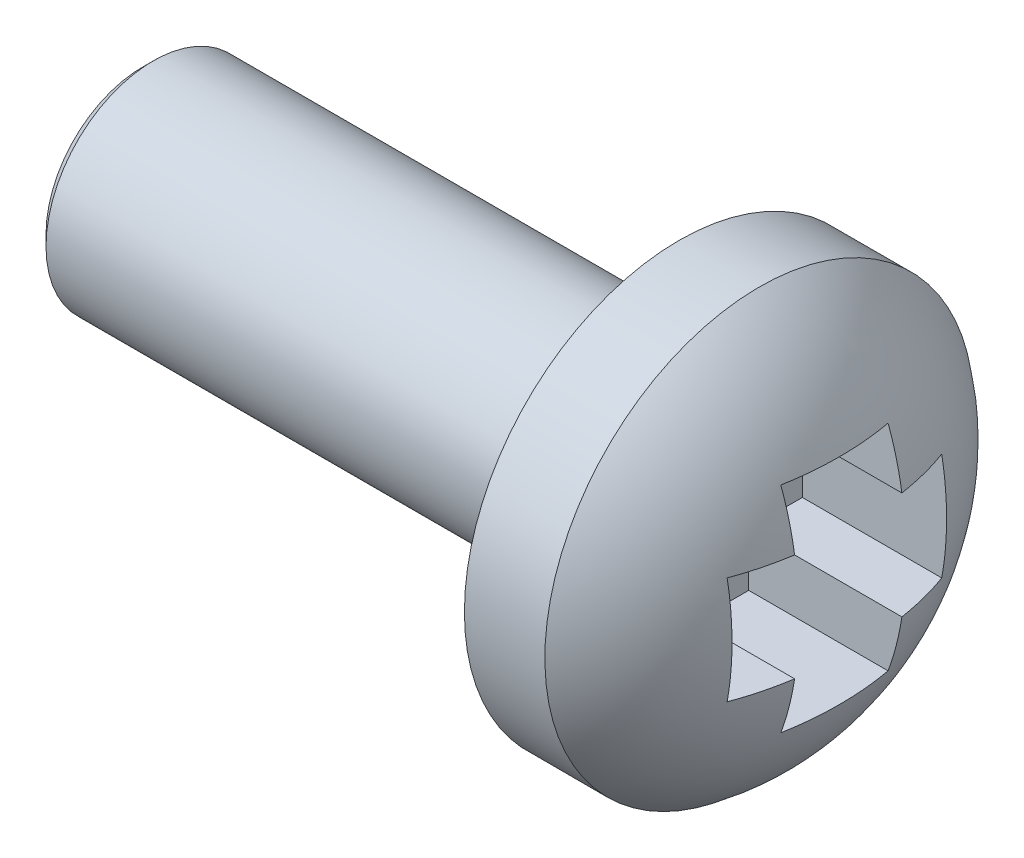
ISO-10303-21;
HEADER;
FILE_DESCRIPTION(('STEP AP214'),'2;1');
FILE_NAME('part.step','',(''),(''),'','','');
FILE_SCHEMA(('AUTOMOTIVE_DESIGN { 1 0 10303 214 1 1 1 1 }'));
ENDSEC;
DATA;
#1=APPLICATION_CONTEXT('core data for automotive mechanical design processes');
#2=APPLICATION_PROTOCOL_DEFINITION('international standard','automotive_design',2000,#1);
#3=PRODUCT_CONTEXT('',#1,'mechanical');
#4=PRODUCT('Part','Part','',(#3));
#5=PRODUCT_RELATED_PRODUCT_CATEGORY('part','',(#4));
#6=PRODUCT_DEFINITION_FORMATION('','',#4);
#7=PRODUCT_DEFINITION_CONTEXT('part definition',#1,'design');
#8=PRODUCT_DEFINITION('design','',#6,#7);
#9=PRODUCT_DEFINITION_SHAPE('','',#8);
#10=(LENGTH_UNIT() NAMED_UNIT(*) SI_UNIT(.MILLI.,.METRE.));
#11=(NAMED_UNIT(*) PLANE_ANGLE_UNIT() SI_UNIT($,.RADIAN.));
#12=(NAMED_UNIT(*) SI_UNIT($,.STERADIAN.) SOLID_ANGLE_UNIT());
#13=UNCERTAINTY_MEASURE_WITH_UNIT(LENGTH_MEASURE(1.E-05),#10,'distance_accuracy_value','');
#14=(GEOMETRIC_REPRESENTATION_CONTEXT(3) GLOBAL_UNCERTAINTY_ASSIGNED_CONTEXT((#13)) GLOBAL_UNIT_ASSIGNED_CONTEXT((#10,
#11,#12)) REPRESENTATION_CONTEXT('',''));
#15=CARTESIAN_POINT('',(0.,0.,0.));
#16=DIRECTION('',(0.,0.,1.));
#17=DIRECTION('',(1.,0.,0.));
#18=AXIS2_PLACEMENT_3D('',#15,#16,#17);
#19=CARTESIAN_POINT('',(3.,0.,0.));
#20=CARTESIAN_POINT('',(3.,-2.69179906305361,0.));
#21=CARTESIAN_POINT('',(1.2,-4.,0.));
#22=B_SPLINE_CURVE_WITH_KNOTS('',2,(#19,#20,#21),.UNSPECIFIED.,.F.,.F.,(3,3),(0.,1.),.UNSPECIFIED.);
#23=CARTESIAN_POINT('',(11.0618266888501,0.,0.));
#24=DIRECTION('',(1.,0.,0.));
#25=AXIS1_PLACEMENT('',#23,#24);
#26=SURFACE_OF_REVOLUTION('',#22,#25);
#27=CARTESIAN_POINT('',(1.2,0.,0.));
#28=DIRECTION('',(1.,0.,0.));
#29=DIRECTION('',(0.,0.,-1.));
#30=AXIS2_PLACEMENT_3D('',#27,#28,#29);
#31=CIRCLE('',#30,4.);
#32=CARTESIAN_POINT('',(1.2,0.,-4.));
#33=VERTEX_POINT('',#32);
#34=EDGE_CURVE('E265',#33,#33,#31,.T.);
#35=ORIENTED_EDGE('',*,*,#34,.T.);
#36=EDGE_LOOP('',(#35));
#37=FACE_BOUND('',#36,.T.);
#38=CARTESIAN_POINT('',(2.59763159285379,1.,2.));
#39=CARTESIAN_POINT('',(2.64990824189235,1.,1.86011806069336));
#40=CARTESIAN_POINT('',(2.69525044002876,1.,1.71774140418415));
#41=CARTESIAN_POINT('',(2.77297852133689,1.,1.43010339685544));
#42=CARTESIAN_POINT('',(2.80541708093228,1.,1.28485636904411));
#43=CARTESIAN_POINT('',(2.83623705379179,1.,1.1155806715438));
#44=CARTESIAN_POINT('',(2.8402891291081,1.,1.09250714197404));
#45=CARTESIAN_POINT('',(2.84811229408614,1.,1.04629699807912));
#46=CARTESIAN_POINT('',(2.85188319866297,1.,1.02316035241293));
#47=CARTESIAN_POINT('',(2.85551487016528,1.,0.999999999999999));
#48=B_SPLINE_CURVE_WITH_KNOTS('',3,(#38,#39,#40,#41,#42,#43,#44,#45,#46,#47),.UNSPECIFIED.,.F.,
.F.,(4,2,2,2,4),(0.,0.44771087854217,0.893574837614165,0.963854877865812,1.0341807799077),.UNSPECIFIED.);
#49=CARTESIAN_POINT('',(2.59763159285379,1.,2.));
#50=VERTEX_POINT('',#49);
#51=CARTESIAN_POINT('',(2.85551487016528,1.,0.999999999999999));
#52=VERTEX_POINT('',#51);
#53=EDGE_CURVE('E167',#50,#52,#48,.T.);
#54=ORIENTED_EDGE('',*,*,#53,.T.);
#55=CARTESIAN_POINT('',(2.85551487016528,1.,0.999999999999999));
#56=CARTESIAN_POINT('',(2.84882371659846,1.04267279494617,0.999999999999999));
#57=CARTESIAN_POINT('',(2.84165816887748,1.08527202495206,0.999999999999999));
#58=CARTESIAN_POINT('',(2.8263643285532,1.17021744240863,0.999999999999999));
#59=CARTESIAN_POINT('',(2.81823780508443,1.21256394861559,0.999999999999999));
#60=CARTESIAN_POINT('',(2.80099503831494,1.29699886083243,0.999999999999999));
#61=CARTESIAN_POINT('',(2.7918800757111,1.33908752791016,0.999999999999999));
#62=CARTESIAN_POINT('',(2.77263126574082,1.4230006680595,0.999999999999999));
#63=CARTESIAN_POINT('',(2.76249813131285,1.46482530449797,0.999999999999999));
#64=CARTESIAN_POINT('',(2.74117954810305,1.5482124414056,0.999999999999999));
#65=CARTESIAN_POINT('',(2.72999394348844,1.58977490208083,0.999999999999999));
#66=CARTESIAN_POINT('',(2.70653959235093,1.67261926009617,0.999999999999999));
#67=CARTESIAN_POINT('',(2.69427022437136,1.7139009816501,0.999999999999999));
#68=CARTESIAN_POINT('',(2.66861382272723,1.79617326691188,0.999999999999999));
#69=CARTESIAN_POINT('',(2.65522539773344,1.83716339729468,0.999999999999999));
#70=CARTESIAN_POINT('',(2.62729518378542,1.91884083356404,0.999999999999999));
#71=CARTESIAN_POINT('',(2.61275112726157,1.95952736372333,0.999999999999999));
#72=CARTESIAN_POINT('',(2.59763159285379,2.,0.999999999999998));
#73=B_SPLINE_CURVE_WITH_KNOTS('',3,(#55,#56,#57,#58,#59,#60,#61,#62,#63,#64,#65,#66,#67,#68,#69,
#70,#71,#72),.UNSPECIFIED.,.F.,.F.,(4,2,2,2,2,2,2,2,4),(0.,0.129581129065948,0.258927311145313,
0.388107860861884,0.517198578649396,0.64630844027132,0.775492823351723,0.904840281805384,
1.03444812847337),.UNSPECIFIED.);
#74=CARTESIAN_POINT('',(2.59763159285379,2.,0.999999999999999));
#75=VERTEX_POINT('',#74);
#76=EDGE_CURVE('E11',#52,#75,#73,.T.);
#77=ORIENTED_EDGE('',*,*,#76,.T.);
#78=CARTESIAN_POINT('',(2.59763159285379,2.,0.999999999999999));
#79=CARTESIAN_POINT('',(2.61134650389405,2.,0.926557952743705));
#80=CARTESIAN_POINT('',(2.62344845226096,2.,0.852830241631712));
#81=CARTESIAN_POINT('',(2.64451489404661,2.,0.704941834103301));
#82=CARTESIAN_POINT('',(2.65347999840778,2.,0.630781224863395));
#83=CARTESIAN_POINT('',(2.67569996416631,2.,0.408910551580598));
#84=CARTESIAN_POINT('',(2.68447871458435,2.,0.260724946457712));
#85=CARTESIAN_POINT('',(2.68927350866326,2.,0.0197303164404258));
#86=CARTESIAN_POINT('',(2.68883819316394,2.,-0.073032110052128));
#87=CARTESIAN_POINT('',(2.683394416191,2.,-0.258430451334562));
#88=CARTESIAN_POINT('',(2.67838598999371,2.,-0.351066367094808));
#89=CARTESIAN_POINT('',(2.66365386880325,2.,-0.536814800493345));
#90=CARTESIAN_POINT('',(2.65388758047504,2.,-0.629923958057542));
#91=CARTESIAN_POINT('',(2.62946567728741,2.,-0.815508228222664));
#92=CARTESIAN_POINT('',(2.61480949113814,2.,-0.907983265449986));
#93=CARTESIAN_POINT('',(2.59763159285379,2.,-1.));
#94=B_SPLINE_CURVE_WITH_KNOTS('',3,(#78,#79,#80,#81,#82,#83,#84,#85,#86,#87,#88,#89,#90,#91,#92,
#93),.UNSPECIFIED.,.F.,.F.,(4,2,2,2,2,2,2,4),(0.,0.224089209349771,0.448134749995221,
0.892921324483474,1.17111885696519,1.44931424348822,1.7300471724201,2.01081291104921),.UNSPECIFIED.);
#95=CARTESIAN_POINT('',(2.59763159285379,2.,-1.));
#96=VERTEX_POINT('',#95);
#97=EDGE_CURVE('E45',#75,#96,#94,.T.);
#98=ORIENTED_EDGE('',*,*,#97,.T.);
#99=CARTESIAN_POINT('',(2.59763159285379,2.,-1.));
#100=CARTESIAN_POINT('',(2.64990824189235,1.86011806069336,-1.));
#101=CARTESIAN_POINT('',(2.69525044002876,1.71774140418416,-1.));
#102=CARTESIAN_POINT('',(2.77297852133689,1.43010339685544,-1.));
#103=CARTESIAN_POINT('',(2.80541708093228,1.28485636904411,-1.));
#104=CARTESIAN_POINT('',(2.83623705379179,1.1155806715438,-1.));
#105=CARTESIAN_POINT('',(2.8402891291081,1.09250714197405,-1.));
#106=CARTESIAN_POINT('',(2.84811229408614,1.04629699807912,-1.));
#107=CARTESIAN_POINT('',(2.85188319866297,1.02316035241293,-1.));
#108=CARTESIAN_POINT('',(2.85551487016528,1.,-1.));
#109=B_SPLINE_CURVE_WITH_KNOTS('',3,(#99,#100,#101,#102,#103,#104,#105,#106,#107,#108),
.UNSPECIFIED.,.F.,.F.,(4,2,2,2,4),(0.,0.447710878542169,0.893574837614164,0.963854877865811,
1.0341807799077),.UNSPECIFIED.);
#110=CARTESIAN_POINT('',(2.85551487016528,1.,-1.));
#111=VERTEX_POINT('',#110);
#112=EDGE_CURVE('E231',#96,#111,#109,.T.);
#113=ORIENTED_EDGE('',*,*,#112,.T.);
#114=CARTESIAN_POINT('',(2.85551487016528,1.,-1.));
#115=CARTESIAN_POINT('',(2.84882371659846,1.,-1.04267279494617));
#116=CARTESIAN_POINT('',(2.84165816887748,1.,-1.08527202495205));
#117=CARTESIAN_POINT('',(2.8263643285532,1.,-1.17021744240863));
#118=CARTESIAN_POINT('',(2.81823780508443,1.,-1.21256394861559));
#119=CARTESIAN_POINT('',(2.80099503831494,1.,-1.29699886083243));
#120=CARTESIAN_POINT('',(2.7918800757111,1.,-1.33908752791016));
#121=CARTESIAN_POINT('',(2.77263126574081,1.,-1.4230006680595));
#122=CARTESIAN_POINT('',(2.76249813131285,1.,-1.46482530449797));
#123=CARTESIAN_POINT('',(2.74117954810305,1.,-1.5482124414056));
#124=CARTESIAN_POINT('',(2.72999394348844,1.,-1.58977490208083));
#125=CARTESIAN_POINT('',(2.70653959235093,1.,-1.67261926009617));
#126=CARTESIAN_POINT('',(2.69427022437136,1.,-1.7139009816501));
#127=CARTESIAN_POINT('',(2.66861382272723,1.,-1.79617326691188));
#128=CARTESIAN_POINT('',(2.65522539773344,1.,-1.83716339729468));
#129=CARTESIAN_POINT('',(2.62729518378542,1.,-1.91884083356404));
#130=CARTESIAN_POINT('',(2.61275112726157,1.,-1.95952736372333));
#131=CARTESIAN_POINT('',(2.59763159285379,1.,-2.));
#132=B_SPLINE_CURVE_WITH_KNOTS('',3,(#114,#115,#116,#117,#118,#119,#120,#121,#122,#123,#124,
#125,#126,#127,#128,#129,#130,#131),.UNSPECIFIED.,.F.,.F.,(4,2,2,2,2,2,2,2,4),(0.,
0.129581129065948,0.258927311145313,0.388107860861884,0.517198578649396,0.64630844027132,
0.775492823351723,0.904840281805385,1.03444812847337),.UNSPECIFIED.);
#133=CARTESIAN_POINT('',(2.59763159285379,1.,-2.));
#134=VERTEX_POINT('',#133);
#135=EDGE_CURVE('E225',#111,#134,#132,.T.);
#136=ORIENTED_EDGE('',*,*,#135,.T.);
#137=CARTESIAN_POINT('',(2.59763159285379,1.,-2.));
#138=CARTESIAN_POINT('',(2.61134650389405,0.926557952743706,-2.));
#139=CARTESIAN_POINT('',(2.62344845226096,0.852830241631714,-2.));
#140=CARTESIAN_POINT('',(2.64451489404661,0.704941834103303,-2.));
#141=CARTESIAN_POINT('',(2.65347999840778,0.630781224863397,-2.));
#142=CARTESIAN_POINT('',(2.6756999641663,0.4089105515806,-2.));
#143=CARTESIAN_POINT('',(2.68447871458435,0.260724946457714,-2.));
#144=CARTESIAN_POINT('',(2.68927350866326,0.0197303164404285,-2.));
#145=CARTESIAN_POINT('',(2.68883819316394,-0.073032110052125,-2.));
#146=CARTESIAN_POINT('',(2.683394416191,-0.258430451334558,-2.));
#147=CARTESIAN_POINT('',(2.67838598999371,-0.351066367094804,-2.));
#148=CARTESIAN_POINT('',(2.66365386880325,-0.53681480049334,-2.));
#149=CARTESIAN_POINT('',(2.65388758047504,-0.629923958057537,-2.));
#150=CARTESIAN_POINT('',(2.62946567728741,-0.815508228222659,-2.));
#151=CARTESIAN_POINT('',(2.61480949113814,-0.907983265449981,-2.));
#152=CARTESIAN_POINT('',(2.59763159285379,-0.999999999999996,-2.));
#153=B_SPLINE_CURVE_WITH_KNOTS('',3,(#137,#138,#139,#140,#141,#142,#143,#144,#145,#146,#147,
#148,#149,#150,#151,#152),.UNSPECIFIED.,.F.,.F.,(4,2,2,2,2,2,2,4),(0.,0.224089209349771,
0.448134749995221,0.892921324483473,1.17111885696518,1.44931424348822,1.7300471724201,
2.01081291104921),.UNSPECIFIED.);
#154=CARTESIAN_POINT('',(2.5976315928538,-0.999999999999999,-2.));
#155=VERTEX_POINT('',#154);
#156=EDGE_CURVE('E218',#134,#155,#153,.T.);
#157=ORIENTED_EDGE('',*,*,#156,.T.);
#158=CARTESIAN_POINT('',(2.5976315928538,-0.999999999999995,-2.));
#159=CARTESIAN_POINT('',(2.64990824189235,-0.999999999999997,-1.86011806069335));
#160=CARTESIAN_POINT('',(2.69525044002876,-0.999999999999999,-1.71774140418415));
#161=CARTESIAN_POINT('',(2.77297852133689,-1.,-1.43010339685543));
#162=CARTESIAN_POINT('',(2.80541708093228,-1.,-1.2848563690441));
#163=CARTESIAN_POINT('',(2.83623705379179,-0.999999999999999,-1.1155806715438));
#164=CARTESIAN_POINT('',(2.8402891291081,-0.999999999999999,-1.09250714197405));
#165=CARTESIAN_POINT('',(2.84811229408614,-0.999999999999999,-1.04629699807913));
#166=CARTESIAN_POINT('',(2.85188319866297,-0.999999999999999,-1.02316035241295));
#167=CARTESIAN_POINT('',(2.85551487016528,-0.999999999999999,-1.00000000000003));
#168=B_SPLINE_CURVE_WITH_KNOTS('',3,(#158,#159,#160,#161,#162,#163,#164,#165,#166,#167),
.UNSPECIFIED.,.F.,.F.,(4,2,2,2,4),(0.,0.44771087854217,0.893574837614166,0.963854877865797,
1.03418077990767),.UNSPECIFIED.);
#169=CARTESIAN_POINT('',(2.85551487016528,-0.999999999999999,-1.));
#170=VERTEX_POINT('',#169);
#171=EDGE_CURVE('E211',#155,#170,#168,.T.);
#172=ORIENTED_EDGE('',*,*,#171,.T.);
#173=CARTESIAN_POINT('',(2.85551487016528,-0.999999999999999,-1.));
#174=CARTESIAN_POINT('',(2.84882371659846,-1.04267279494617,-1.));
#175=CARTESIAN_POINT('',(2.84165816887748,-1.08527202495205,-1.));
#176=CARTESIAN_POINT('',(2.8263643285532,-1.17021744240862,-1.));
#177=CARTESIAN_POINT('',(2.81823780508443,-1.21256394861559,-1.));
#178=CARTESIAN_POINT('',(2.80099503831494,-1.29699886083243,-1.));
#179=CARTESIAN_POINT('',(2.7918800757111,-1.33908752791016,-1.));
#180=CARTESIAN_POINT('',(2.77263126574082,-1.4230006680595,-1.));
#181=CARTESIAN_POINT('',(2.76249813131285,-1.46482530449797,-1.));
#182=CARTESIAN_POINT('',(2.74117954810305,-1.5482124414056,-1.));
#183=CARTESIAN_POINT('',(2.72999394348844,-1.58977490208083,-1.));
#184=CARTESIAN_POINT('',(2.70653959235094,-1.67261926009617,-1.));
#185=CARTESIAN_POINT('',(2.69427022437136,-1.7139009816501,-1.));
#186=CARTESIAN_POINT('',(2.66861382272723,-1.79617326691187,-1.));
#187=CARTESIAN_POINT('',(2.65522539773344,-1.83716339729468,-1.));
#188=CARTESIAN_POINT('',(2.62729518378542,-1.91884083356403,-1.));
#189=CARTESIAN_POINT('',(2.61275112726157,-1.95952736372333,-1.));
#190=CARTESIAN_POINT('',(2.59763159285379,-2.,-0.999999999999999));
#191=B_SPLINE_CURVE_WITH_KNOTS('',3,(#173,#174,#175,#176,#177,#178,#179,#180,#181,#182,#183,
#184,#185,#186,#187,#188,#189,#190),.UNSPECIFIED.,.F.,.F.,(4,2,2,2,2,2,2,2,4),(0.,
0.129581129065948,0.258927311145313,0.388107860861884,0.517198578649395,0.646308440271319,
0.775492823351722,0.904840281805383,1.03444812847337),.UNSPECIFIED.);
#192=CARTESIAN_POINT('',(2.59763159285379,-2.,-1.));
#193=VERTEX_POINT('',#192);
#194=EDGE_CURVE('E204',#170,#193,#191,.T.);
#195=ORIENTED_EDGE('',*,*,#194,.T.);
#196=CARTESIAN_POINT('',(2.59763159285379,-2.,-1.));
#197=CARTESIAN_POINT('',(2.61134650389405,-2.,-0.926557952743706));
#198=CARTESIAN_POINT('',(2.62344845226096,-2.,-0.852830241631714));
#199=CARTESIAN_POINT('',(2.64451489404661,-2.,-0.704941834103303));
#200=CARTESIAN_POINT('',(2.65347999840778,-2.,-0.630781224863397));
#201=CARTESIAN_POINT('',(2.6756999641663,-2.,-0.4089105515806));
#202=CARTESIAN_POINT('',(2.68447871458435,-2.,-0.260724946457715));
#203=CARTESIAN_POINT('',(2.68927350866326,-2.,-0.0197303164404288));
#204=CARTESIAN_POINT('',(2.68883819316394,-2.,0.0730321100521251));
#205=CARTESIAN_POINT('',(2.683394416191,-2.,0.258430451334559));
#206=CARTESIAN_POINT('',(2.67838598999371,-2.,0.351066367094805));
#207=CARTESIAN_POINT('',(2.66365386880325,-2.,0.536814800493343));
#208=CARTESIAN_POINT('',(2.65388758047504,-2.,0.62992395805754));
#209=CARTESIAN_POINT('',(2.62946567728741,-2.,0.815508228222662));
#210=CARTESIAN_POINT('',(2.61480949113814,-2.,0.907983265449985));
#211=CARTESIAN_POINT('',(2.59763159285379,-2.,1.));
#212=B_SPLINE_CURVE_WITH_KNOTS('',3,(#196,#197,#198,#199,#200,#201,#202,#203,#204,#205,#206,
#207,#208,#209,#210,#211),.UNSPECIFIED.,.F.,.F.,(4,2,2,2,2,2,2,4),(0.,0.22408920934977,
0.44813474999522,0.892921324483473,1.17111885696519,1.44931424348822,1.7300471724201,
2.01081291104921),.UNSPECIFIED.);
#213=CARTESIAN_POINT('',(2.59763159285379,-2.,1.));
#214=VERTEX_POINT('',#213);
#215=EDGE_CURVE('E197',#193,#214,#212,.T.);
#216=ORIENTED_EDGE('',*,*,#215,.T.);
#217=CARTESIAN_POINT('',(2.59763159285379,-2.,1.));
#218=CARTESIAN_POINT('',(2.64990824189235,-1.86011806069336,1.));
#219=CARTESIAN_POINT('',(2.69525044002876,-1.71774140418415,1.));
#220=CARTESIAN_POINT('',(2.77297852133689,-1.43010339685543,1.));
#221=CARTESIAN_POINT('',(2.80541708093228,-1.28485636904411,1.));
#222=CARTESIAN_POINT('',(2.83623705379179,-1.1155806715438,1.));
#223=CARTESIAN_POINT('',(2.8402891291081,-1.09250714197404,1.));
#224=CARTESIAN_POINT('',(2.84811229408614,-1.04629699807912,1.));
#225=CARTESIAN_POINT('',(2.85188319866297,-1.02316035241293,1.));
#226=CARTESIAN_POINT('',(2.85551487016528,-0.999999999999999,1.));
#227=B_SPLINE_CURVE_WITH_KNOTS('',3,(#217,#218,#219,#220,#221,#222,#223,#224,#225,#226),
.UNSPECIFIED.,.F.,.F.,(4,2,2,2,4),(0.,0.44771087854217,0.893574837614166,0.963854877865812,
1.0341807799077),.UNSPECIFIED.);
#228=CARTESIAN_POINT('',(2.85551487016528,-0.999999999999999,1.));
#229=VERTEX_POINT('',#228);
#230=EDGE_CURVE('E190',#214,#229,#227,.T.);
#231=ORIENTED_EDGE('',*,*,#230,.T.);
#232=CARTESIAN_POINT('',(2.85551487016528,-0.999999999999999,1.));
#233=CARTESIAN_POINT('',(2.84882371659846,-0.999999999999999,1.04267279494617));
#234=CARTESIAN_POINT('',(2.84165816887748,-0.999999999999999,1.08527202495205));
#235=CARTESIAN_POINT('',(2.8263643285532,-0.999999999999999,1.17021744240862));
#236=CARTESIAN_POINT('',(2.81823780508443,-0.999999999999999,1.21256394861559));
#237=CARTESIAN_POINT('',(2.80099503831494,-0.999999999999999,1.29699886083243));
#238=CARTESIAN_POINT('',(2.7918800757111,-0.999999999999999,1.33908752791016));
#239=CARTESIAN_POINT('',(2.77263126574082,-0.999999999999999,1.4230006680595));
#240=CARTESIAN_POINT('',(2.76249813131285,-0.999999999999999,1.46482530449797));
#241=CARTESIAN_POINT('',(2.74117954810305,-0.999999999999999,1.5482124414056));
#242=CARTESIAN_POINT('',(2.72999394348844,-0.999999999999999,1.58977490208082));
#243=CARTESIAN_POINT('',(2.70653959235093,-0.999999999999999,1.67261926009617));
#244=CARTESIAN_POINT('',(2.69427022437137,-0.999999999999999,1.7139009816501));
#245=CARTESIAN_POINT('',(2.66861382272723,-0.999999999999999,1.79617326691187));
#246=CARTESIAN_POINT('',(2.65522539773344,-0.999999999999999,1.83716339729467));
#247=CARTESIAN_POINT('',(2.62729518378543,-0.999999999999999,1.91884083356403));
#248=CARTESIAN_POINT('',(2.61275112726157,-0.999999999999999,1.95952736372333));
#249=CARTESIAN_POINT('',(2.59763159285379,-0.999999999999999,1.99999999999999));
#250=B_SPLINE_CURVE_WITH_KNOTS('',3,(#232,#233,#234,#235,#236,#237,#238,#239,#240,#241,#242,
#243,#244,#245,#246,#247,#248,#249),.UNSPECIFIED.,.F.,.F.,(4,2,2,2,2,2,2,2,4),(0.,
0.129581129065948,0.258927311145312,0.388107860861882,0.517198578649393,0.646308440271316,
0.775492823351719,0.904840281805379,1.03444812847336),.UNSPECIFIED.);
#251=CARTESIAN_POINT('',(2.5976315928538,-0.999999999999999,2.));
#252=VERTEX_POINT('',#251);
#253=EDGE_CURVE('E183',#229,#252,#250,.T.);
#254=ORIENTED_EDGE('',*,*,#253,.T.);
#255=CARTESIAN_POINT('',(2.5976315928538,-0.999999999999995,2.));
#256=CARTESIAN_POINT('',(2.61134650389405,-0.9265579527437,2.));
#257=CARTESIAN_POINT('',(2.62344845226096,-0.852830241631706,2.));
#258=CARTESIAN_POINT('',(2.64451489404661,-0.704941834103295,2.));
#259=CARTESIAN_POINT('',(2.65347999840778,-0.630781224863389,2.));
#260=CARTESIAN_POINT('',(2.67569996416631,-0.408910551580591,2.));
#261=CARTESIAN_POINT('',(2.68447871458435,-0.260724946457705,2.));
#262=CARTESIAN_POINT('',(2.68927350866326,-0.0197303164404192,2.));
#263=CARTESIAN_POINT('',(2.68883819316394,0.0730321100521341,2.));
#264=CARTESIAN_POINT('',(2.683394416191,0.258430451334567,2.));
#265=CARTESIAN_POINT('',(2.67838598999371,0.351066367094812,2.));
#266=CARTESIAN_POINT('',(2.66365386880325,0.536814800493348,2.));
#267=CARTESIAN_POINT('',(2.65388758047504,0.629923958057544,2.));
#268=CARTESIAN_POINT('',(2.62946567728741,0.815508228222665,2.));
#269=CARTESIAN_POINT('',(2.61480949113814,0.907983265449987,2.));
#270=CARTESIAN_POINT('',(2.59763159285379,1.,2.));
#271=B_SPLINE_CURVE_WITH_KNOTS('',3,(#255,#256,#257,#258,#259,#260,#261,#262,#263,#264,#265,
#266,#267,#268,#269,#270),.UNSPECIFIED.,.F.,.F.,(4,2,2,2,2,2,2,4),(0.,0.224089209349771,
0.448134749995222,0.892921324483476,1.17111885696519,1.44931424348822,1.7300471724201,
2.01081291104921),.UNSPECIFIED.);
#272=EDGE_CURVE('E176',#252,#50,#271,.T.);
#273=ORIENTED_EDGE('',*,*,#272,.T.);
#274=EDGE_LOOP('',(#54,#77,#98,#113,#136,#157,#172,#195,#216,#231,#254,#273));
#275=FACE_BOUND('',#274,.T.);
#276=ADVANCED_FACE('F33',(#37,#275),#26,.F.);
#277=CARTESIAN_POINT('',(11.0618266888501,0.,0.));
#278=DIRECTION('',(1.,0.,0.));
#279=DIRECTION('',(0.,0.,-1.));
#280=AXIS2_PLACEMENT_3D('',#277,#278,#279);
#281=CYLINDRICAL_SURFACE('',#280,4.);
#282=CARTESIAN_POINT('',(-0.3,0.,0.));
#283=DIRECTION('',(1.,0.,0.));
#284=DIRECTION('',(0.,0.,-1.));
#285=AXIS2_PLACEMENT_3D('',#282,#283,#284);
#286=CIRCLE('',#285,4.);
#287=CARTESIAN_POINT('',(-0.3,0.,-4.));
#288=VERTEX_POINT('',#287);
#289=EDGE_CURVE('E145',#288,#288,#286,.T.);
#290=ORIENTED_EDGE('',*,*,#289,.T.);
#291=EDGE_LOOP('',(#290));
#292=FACE_BOUND('',#291,.T.);
#293=ORIENTED_EDGE('',*,*,#34,.F.);
#294=EDGE_LOOP('',(#293));
#295=FACE_BOUND('',#294,.T.);
#296=ADVANCED_FACE('F161',(#292,#295),#281,.T.);
#297=CARTESIAN_POINT('',(-0.3,-2.,0.));
#298=DIRECTION('',(-1.,0.,0.));
#299=DIRECTION('',(0.,0.,1.));
#300=AXIS2_PLACEMENT_3D('',#297,#298,#299);
#301=PLANE('',#300);
#302=CARTESIAN_POINT('',(-0.3,0.,0.));
#303=DIRECTION('',(1.,0.,0.));
#304=DIRECTION('',(0.,0.,-1.));
#305=AXIS2_PLACEMENT_3D('',#302,#303,#304);
#306=CIRCLE('',#305,2.);
#307=CARTESIAN_POINT('',(-0.3,0.,-2.));
#308=VERTEX_POINT('',#307);
#309=EDGE_CURVE('E141',#308,#308,#306,.T.);
#310=ORIENTED_EDGE('',*,*,#309,.T.);
#311=EDGE_LOOP('',(#310));
#312=FACE_BOUND('',#311,.T.);
#313=ORIENTED_EDGE('',*,*,#289,.F.);
#314=EDGE_LOOP('',(#313));
#315=FACE_BOUND('',#314,.T.);
#316=ADVANCED_FACE('F253',(#312,#315),#301,.T.);
#317=CARTESIAN_POINT('',(11.0618266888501,0.,0.));
#318=DIRECTION('',(1.,0.,0.));
#319=DIRECTION('',(0.,0.,-1.));
#320=AXIS2_PLACEMENT_3D('',#317,#318,#319);
#321=CYLINDRICAL_SURFACE('',#320,2.);
#322=CARTESIAN_POINT('',(-10.1,0.,0.));
#323=DIRECTION('',(-1.,0.,0.));
#324=DIRECTION('',(0.,0.,1.));
#325=AXIS2_PLACEMENT_3D('',#322,#323,#324);
#326=CIRCLE('',#325,2.);
#327=CARTESIAN_POINT('',(-10.1,0.,2.));
#328=VERTEX_POINT('',#327);
#329=EDGE_CURVE('E267',#328,#328,#326,.F.);
#330=ORIENTED_EDGE('',*,*,#329,.T.);
#331=EDGE_LOOP('',(#330));
#332=FACE_BOUND('',#331,.T.);
#333=ORIENTED_EDGE('',*,*,#309,.F.);
#334=EDGE_LOOP('',(#333));
#335=FACE_BOUND('',#334,.T.);
#336=ADVANCED_FACE('F250',(#332,#335),#321,.T.);
#337=CARTESIAN_POINT('',(-10.3,-2.,0.));
#338=DIRECTION('',(-1.,0.,0.));
#339=DIRECTION('',(0.,0.,1.));
#340=AXIS2_PLACEMENT_3D('',#337,#338,#339);
#341=PLANE('',#340);
#342=CARTESIAN_POINT('',(-10.3,0.,0.));
#343=DIRECTION('',(-1.,0.,0.));
#344=DIRECTION('',(0.,0.,1.));
#345=AXIS2_PLACEMENT_3D('',#342,#343,#344);
#346=CIRCLE('',#345,1.79999999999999);
#347=CARTESIAN_POINT('',(-10.3,0.,1.79999999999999));
#348=VERTEX_POINT('',#347);
#349=EDGE_CURVE('E271',#348,#348,#346,.T.);
#350=ORIENTED_EDGE('',*,*,#349,.T.);
#351=EDGE_LOOP('',(#350));
#352=FACE_BOUND('',#351,.T.);
#353=ADVANCED_FACE('F247',(#352),#341,.T.);
#354=CARTESIAN_POINT('',(-10.1,0.,0.));
#355=DIRECTION('',(1.,0.,0.));
#356=DIRECTION('',(0.,0.,-1.));
#357=AXIS2_PLACEMENT_3D('',#354,#355,#356);
#358=CONICAL_SURFACE('',#357,2.,0.785398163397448);
#359=ORIENTED_EDGE('',*,*,#349,.F.);
#360=EDGE_LOOP('',(#359));
#361=FACE_BOUND('',#360,.T.);
#362=ORIENTED_EDGE('',*,*,#329,.F.);
#363=EDGE_LOOP('',(#362));
#364=FACE_BOUND('',#363,.T.);
#365=ADVANCED_FACE('F35',(#361,#364),#358,.T.);
#366=CARTESIAN_POINT('',(0.,2.,0.999999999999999));
#367=DIRECTION('',(0.,0.,-1.));
#368=DIRECTION('',(-1.,0.,0.));
#369=AXIS2_PLACEMENT_3D('',#366,#367,#368);
#370=PLANE('',#369);
#371=DIRECTION('',(1.,0.,0.));
#372=VECTOR('',#371,1.);
#373=CARTESIAN_POINT('',(0.,1.,0.999999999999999));
#374=LINE('',#373,#372);
#375=CARTESIAN_POINT('',(0.,1.,0.999999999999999));
#376=VERTEX_POINT('',#375);
#377=EDGE_CURVE('E52',#376,#52,#374,.T.);
#378=ORIENTED_EDGE('',*,*,#377,.F.);
#379=DIRECTION('',(0.,1.,0.));
#380=VECTOR('',#379,1.);
#381=CARTESIAN_POINT('',(0.,2.,0.999999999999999));
#382=LINE('',#381,#380);
#383=CARTESIAN_POINT('',(0.,2.,0.999999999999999));
#384=VERTEX_POINT('',#383);
#385=EDGE_CURVE('E131',#376,#384,#382,.T.);
#386=ORIENTED_EDGE('',*,*,#385,.T.);
#387=DIRECTION('',(1.,0.,0.));
#388=VECTOR('',#387,1.);
#389=CARTESIAN_POINT('',(0.,2.,0.999999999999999));
#390=LINE('',#389,#388);
#391=EDGE_CURVE('E138',#384,#75,#390,.T.);
#392=ORIENTED_EDGE('',*,*,#391,.T.);
#393=ORIENTED_EDGE('',*,*,#76,.F.);
#394=EDGE_LOOP('',(#378,#386,#392,#393));
#395=FACE_BOUND('',#394,.T.);
#396=ADVANCED_FACE('F137',(#395),#370,.T.);
#397=CARTESIAN_POINT('',(0.,2.,0.999999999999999));
#398=DIRECTION('',(0.,-1.,0.));
#399=DIRECTION('',(0.,0.,-1.));
#400=AXIS2_PLACEMENT_3D('',#397,#398,#399);
#401=PLANE('',#400);
#402=ORIENTED_EDGE('',*,*,#391,.F.);
#403=DIRECTION('',(0.,0.,-1.));
#404=VECTOR('',#403,1.);
#405=CARTESIAN_POINT('',(0.,2.,0.999999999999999));
#406=LINE('',#405,#404);
#407=CARTESIAN_POINT('',(0.,2.,-1.));
#408=VERTEX_POINT('',#407);
#409=EDGE_CURVE('E127',#384,#408,#406,.T.);
#410=ORIENTED_EDGE('',*,*,#409,.T.);
#411=DIRECTION('',(1.,0.,0.));
#412=VECTOR('',#411,1.);
#413=CARTESIAN_POINT('',(0.,2.,-1.));
#414=LINE('',#413,#412);
#415=EDGE_CURVE('E142',#408,#96,#414,.T.);
#416=ORIENTED_EDGE('',*,*,#415,.T.);
#417=ORIENTED_EDGE('',*,*,#97,.F.);
#418=EDGE_LOOP('',(#402,#410,#416,#417));
#419=FACE_BOUND('',#418,.T.);
#420=ADVANCED_FACE('F140',(#419),#401,.T.);
#421=CARTESIAN_POINT('',(0.,2.,-1.));
#422=DIRECTION('',(0.,0.,1.));
#423=DIRECTION('',(0.,-1.,0.));
#424=AXIS2_PLACEMENT_3D('',#421,#422,#423);
#425=PLANE('',#424);
#426=ORIENTED_EDGE('',*,*,#415,.F.);
#427=DIRECTION('',(0.,-1.,0.));
#428=VECTOR('',#427,1.);
#429=CARTESIAN_POINT('',(0.,2.,-1.));
#430=LINE('',#429,#428);
#431=CARTESIAN_POINT('',(0.,1.,-1.));
#432=VERTEX_POINT('',#431);
#433=EDGE_CURVE('E133',#408,#432,#430,.T.);
#434=ORIENTED_EDGE('',*,*,#433,.T.);
#435=DIRECTION('',(1.,0.,0.));
#436=VECTOR('',#435,1.);
#437=CARTESIAN_POINT('',(0.,1.,-1.));
#438=LINE('',#437,#436);
#439=EDGE_CURVE('E147',#432,#111,#438,.T.);
#440=ORIENTED_EDGE('',*,*,#439,.T.);
#441=ORIENTED_EDGE('',*,*,#112,.F.);
#442=EDGE_LOOP('',(#426,#434,#440,#441));
#443=FACE_BOUND('',#442,.T.);
#444=ADVANCED_FACE('F242',(#443),#425,.T.);
#445=CARTESIAN_POINT('',(0.,1.,-1.));
#446=DIRECTION('',(0.,-1.,0.));
#447=DIRECTION('',(0.,0.,-1.));
#448=AXIS2_PLACEMENT_3D('',#445,#446,#447);
#449=PLANE('',#448);
#450=ORIENTED_EDGE('',*,*,#439,.F.);
#451=DIRECTION('',(0.,0.,-1.));
#452=VECTOR('',#451,1.);
#453=CARTESIAN_POINT('',(0.,1.,-1.));
#454=LINE('',#453,#452);
#455=CARTESIAN_POINT('',(0.,1.,-2.));
#456=VERTEX_POINT('',#455);
#457=EDGE_CURVE('E331',#432,#456,#454,.T.);
#458=ORIENTED_EDGE('',*,*,#457,.T.);
#459=DIRECTION('',(1.,0.,0.));
#460=VECTOR('',#459,1.);
#461=CARTESIAN_POINT('',(0.,1.,-2.));
#462=LINE('',#461,#460);
#463=EDGE_CURVE('E289',#456,#134,#462,.T.);
#464=ORIENTED_EDGE('',*,*,#463,.T.);
#465=ORIENTED_EDGE('',*,*,#135,.F.);
#466=EDGE_LOOP('',(#450,#458,#464,#465));
#467=FACE_BOUND('',#466,.T.);
#468=ADVANCED_FACE('F334',(#467),#449,.T.);
#469=CARTESIAN_POINT('',(0.,1.,-2.));
#470=DIRECTION('',(0.,0.,1.));
#471=DIRECTION('',(1.,0.,0.));
#472=AXIS2_PLACEMENT_3D('',#469,#470,#471);
#473=PLANE('',#472);
#474=ORIENTED_EDGE('',*,*,#463,.F.);
#475=DIRECTION('',(0.,-1.,0.));
#476=VECTOR('',#475,1.);
#477=CARTESIAN_POINT('',(0.,1.,-2.));
#478=LINE('',#477,#476);
#479=CARTESIAN_POINT('',(0.,-0.999999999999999,-2.));
#480=VERTEX_POINT('',#479);
#481=EDGE_CURVE('E329',#456,#480,#478,.T.);
#482=ORIENTED_EDGE('',*,*,#481,.T.);
#483=DIRECTION('',(1.,0.,0.));
#484=VECTOR('',#483,1.);
#485=CARTESIAN_POINT('',(0.,-0.999999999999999,-2.));
#486=LINE('',#485,#484);
#487=EDGE_CURVE('E291',#480,#155,#486,.T.);
#488=ORIENTED_EDGE('',*,*,#487,.T.);
#489=ORIENTED_EDGE('',*,*,#156,.F.);
#490=EDGE_LOOP('',(#474,#482,#488,#489));
#491=FACE_BOUND('',#490,.T.);
#492=ADVANCED_FACE('F337',(#491),#473,.T.);
#493=CARTESIAN_POINT('',(0.,-0.999999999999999,-1.));
#494=DIRECTION('',(0.,1.,0.));
#495=DIRECTION('',(0.,0.,1.));
#496=AXIS2_PLACEMENT_3D('',#493,#494,#495);
#497=PLANE('',#496);
#498=ORIENTED_EDGE('',*,*,#487,.F.);
#499=DIRECTION('',(0.,0.,1.));
#500=VECTOR('',#499,1.);
#501=CARTESIAN_POINT('',(0.,-0.999999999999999,-1.));
#502=LINE('',#501,#500);
#503=CARTESIAN_POINT('',(0.,-0.999999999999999,-1.));
#504=VERTEX_POINT('',#503);
#505=EDGE_CURVE('E327',#480,#504,#502,.T.);
#506=ORIENTED_EDGE('',*,*,#505,.T.);
#507=DIRECTION('',(1.,0.,0.));
#508=VECTOR('',#507,1.);
#509=CARTESIAN_POINT('',(0.,-0.999999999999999,-1.));
#510=LINE('',#509,#508);
#511=EDGE_CURVE('E296',#504,#170,#510,.T.);
#512=ORIENTED_EDGE('',*,*,#511,.T.);
#513=ORIENTED_EDGE('',*,*,#171,.F.);
#514=EDGE_LOOP('',(#498,#506,#512,#513));
#515=FACE_BOUND('',#514,.T.);
#516=ADVANCED_FACE('F344',(#515),#497,.T.);
#517=CARTESIAN_POINT('',(0.,-0.999999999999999,-1.));
#518=DIRECTION('',(0.,0.,1.));
#519=DIRECTION('',(1.,0.,0.));
#520=AXIS2_PLACEMENT_3D('',#517,#518,#519);
#521=PLANE('',#520);
#522=ORIENTED_EDGE('',*,*,#511,.F.);
#523=DIRECTION('',(0.,-1.,0.));
#524=VECTOR('',#523,1.);
#525=CARTESIAN_POINT('',(0.,-0.999999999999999,-1.));
#526=LINE('',#525,#524);
#527=CARTESIAN_POINT('',(0.,-2.,-1.));
#528=VERTEX_POINT('',#527);
#529=EDGE_CURVE('E325',#504,#528,#526,.T.);
#530=ORIENTED_EDGE('',*,*,#529,.T.);
#531=DIRECTION('',(1.,0.,0.));
#532=VECTOR('',#531,1.);
#533=CARTESIAN_POINT('',(0.,-2.,-1.));
#534=LINE('',#533,#532);
#535=EDGE_CURVE('E299',#528,#193,#534,.T.);
#536=ORIENTED_EDGE('',*,*,#535,.T.);
#537=ORIENTED_EDGE('',*,*,#194,.F.);
#538=EDGE_LOOP('',(#522,#530,#536,#537));
#539=FACE_BOUND('',#538,.T.);
#540=ADVANCED_FACE('F346',(#539),#521,.T.);
#541=CARTESIAN_POINT('',(0.,-2.,1.));
#542=DIRECTION('',(0.,1.,0.));
#543=DIRECTION('',(0.,0.,1.));
#544=AXIS2_PLACEMENT_3D('',#541,#542,#543);
#545=PLANE('',#544);
#546=ORIENTED_EDGE('',*,*,#535,.F.);
#547=DIRECTION('',(0.,0.,1.));
#548=VECTOR('',#547,1.);
#549=CARTESIAN_POINT('',(0.,-2.,1.));
#550=LINE('',#549,#548);
#551=CARTESIAN_POINT('',(0.,-2.,1.));
#552=VERTEX_POINT('',#551);
#553=EDGE_CURVE('E323',#528,#552,#550,.T.);
#554=ORIENTED_EDGE('',*,*,#553,.T.);
#555=DIRECTION('',(1.,0.,0.));
#556=VECTOR('',#555,1.);
#557=CARTESIAN_POINT('',(0.,-2.,1.));
#558=LINE('',#557,#556);
#559=EDGE_CURVE('E302',#552,#214,#558,.T.);
#560=ORIENTED_EDGE('',*,*,#559,.T.);
#561=ORIENTED_EDGE('',*,*,#215,.F.);
#562=EDGE_LOOP('',(#546,#554,#560,#561));
#563=FACE_BOUND('',#562,.T.);
#564=ADVANCED_FACE('F349',(#563),#545,.T.);
#565=CARTESIAN_POINT('',(0.,-0.999999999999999,1.));
#566=DIRECTION('',(0.,0.,-1.));
#567=DIRECTION('',(0.,1.,0.));
#568=AXIS2_PLACEMENT_3D('',#565,#566,#567);
#569=PLANE('',#568);
#570=ORIENTED_EDGE('',*,*,#559,.F.);
#571=DIRECTION('',(0.,1.,0.));
#572=VECTOR('',#571,1.);
#573=CARTESIAN_POINT('',(0.,-0.999999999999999,1.));
#574=LINE('',#573,#572);
#575=CARTESIAN_POINT('',(0.,-0.999999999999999,1.));
#576=VERTEX_POINT('',#575);
#577=EDGE_CURVE('E321',#552,#576,#574,.T.);
#578=ORIENTED_EDGE('',*,*,#577,.T.);
#579=DIRECTION('',(1.,0.,0.));
#580=VECTOR('',#579,1.);
#581=CARTESIAN_POINT('',(0.,-0.999999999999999,1.));
#582=LINE('',#581,#580);
#583=EDGE_CURVE('E305',#576,#229,#582,.T.);
#584=ORIENTED_EDGE('',*,*,#583,.T.);
#585=ORIENTED_EDGE('',*,*,#230,.F.);
#586=EDGE_LOOP('',(#570,#578,#584,#585));
#587=FACE_BOUND('',#586,.T.);
#588=ADVANCED_FACE('F356',(#587),#569,.T.);
#589=CARTESIAN_POINT('',(0.,-0.999999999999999,2.));
#590=DIRECTION('',(0.,1.,0.));
#591=DIRECTION('',(0.,0.,1.));
#592=AXIS2_PLACEMENT_3D('',#589,#590,#591);
#593=PLANE('',#592);
#594=ORIENTED_EDGE('',*,*,#583,.F.);
#595=DIRECTION('',(0.,0.,1.));
#596=VECTOR('',#595,1.);
#597=CARTESIAN_POINT('',(0.,-0.999999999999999,2.));
#598=LINE('',#597,#596);
#599=CARTESIAN_POINT('',(0.,-0.999999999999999,2.));
#600=VERTEX_POINT('',#599);
#601=EDGE_CURVE('E319',#576,#600,#598,.T.);
#602=ORIENTED_EDGE('',*,*,#601,.T.);
#603=DIRECTION('',(1.,0.,0.));
#604=VECTOR('',#603,1.);
#605=CARTESIAN_POINT('',(0.,-0.999999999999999,2.));
#606=LINE('',#605,#604);
#607=EDGE_CURVE('E308',#600,#252,#606,.T.);
#608=ORIENTED_EDGE('',*,*,#607,.T.);
#609=ORIENTED_EDGE('',*,*,#253,.F.);
#610=EDGE_LOOP('',(#594,#602,#608,#609));
#611=FACE_BOUND('',#610,.T.);
#612=ADVANCED_FACE('F358',(#611),#593,.T.);
#613=CARTESIAN_POINT('',(0.,1.,2.));
#614=DIRECTION('',(0.,0.,-1.));
#615=DIRECTION('',(-1.,0.,0.));
#616=AXIS2_PLACEMENT_3D('',#613,#614,#615);
#617=PLANE('',#616);
#618=ORIENTED_EDGE('',*,*,#607,.F.);
#619=DIRECTION('',(0.,1.,0.));
#620=VECTOR('',#619,1.);
#621=CARTESIAN_POINT('',(0.,1.,2.));
#622=LINE('',#621,#620);
#623=CARTESIAN_POINT('',(0.,1.,2.));
#624=VERTEX_POINT('',#623);
#625=EDGE_CURVE('E317',#600,#624,#622,.T.);
#626=ORIENTED_EDGE('',*,*,#625,.T.);
#627=DIRECTION('',(1.,0.,0.));
#628=VECTOR('',#627,1.);
#629=CARTESIAN_POINT('',(0.,1.,2.));
#630=LINE('',#629,#628);
#631=EDGE_CURVE('E311',#624,#50,#630,.T.);
#632=ORIENTED_EDGE('',*,*,#631,.T.);
#633=ORIENTED_EDGE('',*,*,#272,.F.);
#634=EDGE_LOOP('',(#618,#626,#632,#633));
#635=FACE_BOUND('',#634,.T.);
#636=ADVANCED_FACE('F361',(#635),#617,.T.);
#637=CARTESIAN_POINT('',(0.,1.,2.));
#638=DIRECTION('',(0.,-1.,0.));
#639=DIRECTION('',(0.,0.,-1.));
#640=AXIS2_PLACEMENT_3D('',#637,#638,#639);
#641=PLANE('',#640);
#642=ORIENTED_EDGE('',*,*,#631,.F.);
#643=DIRECTION('',(0.,0.,-1.));
#644=VECTOR('',#643,1.);
#645=CARTESIAN_POINT('',(0.,1.,2.));
#646=LINE('',#645,#644);
#647=EDGE_CURVE('E315',#624,#376,#646,.T.);
#648=ORIENTED_EDGE('',*,*,#647,.T.);
#649=ORIENTED_EDGE('',*,*,#377,.T.);
#650=ORIENTED_EDGE('',*,*,#53,.F.);
#651=EDGE_LOOP('',(#642,#648,#649,#650));
#652=FACE_BOUND('',#651,.T.);
#653=ADVANCED_FACE('F363',(#652),#641,.T.);
#654=CARTESIAN_POINT('',(0.,1.,0.999999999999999));
#655=DIRECTION('',(1.,0.,0.));
#656=DIRECTION('',(0.,0.,-1.));
#657=AXIS2_PLACEMENT_3D('',#654,#655,#656);
#658=PLANE('',#657);
#659=ORIENTED_EDGE('',*,*,#385,.F.);
#660=ORIENTED_EDGE('',*,*,#647,.F.);
#661=ORIENTED_EDGE('',*,*,#625,.F.);
#662=ORIENTED_EDGE('',*,*,#601,.F.);
#663=ORIENTED_EDGE('',*,*,#577,.F.);
#664=ORIENTED_EDGE('',*,*,#553,.F.);
#665=ORIENTED_EDGE('',*,*,#529,.F.);
#666=ORIENTED_EDGE('',*,*,#505,.F.);
#667=ORIENTED_EDGE('',*,*,#481,.F.);
#668=ORIENTED_EDGE('',*,*,#457,.F.);
#669=ORIENTED_EDGE('',*,*,#433,.F.);
#670=ORIENTED_EDGE('',*,*,#409,.F.);
#671=EDGE_LOOP('',(#659,#660,#661,#662,#663,#664,#665,#666,#667,#668,#669,#670));
#672=FACE_BOUND('',#671,.T.);
#673=ADVANCED_FACE('F129',(#672),#658,.T.);
#674=CLOSED_SHELL('',(#276,#296,#316,#336,#353,#365,#396,#420,#444,#468,#492,#516,#540,#564,
#588,#612,#636,#653,#673));
#675=MANIFOLD_SOLID_BREP('B2',#674);
#676=ADVANCED_BREP_SHAPE_REPRESENTATION('',(#18,#675),#14);
#677=SHAPE_DEFINITION_REPRESENTATION(#9,#676);
ENDSEC;
END-ISO-10303-21;
